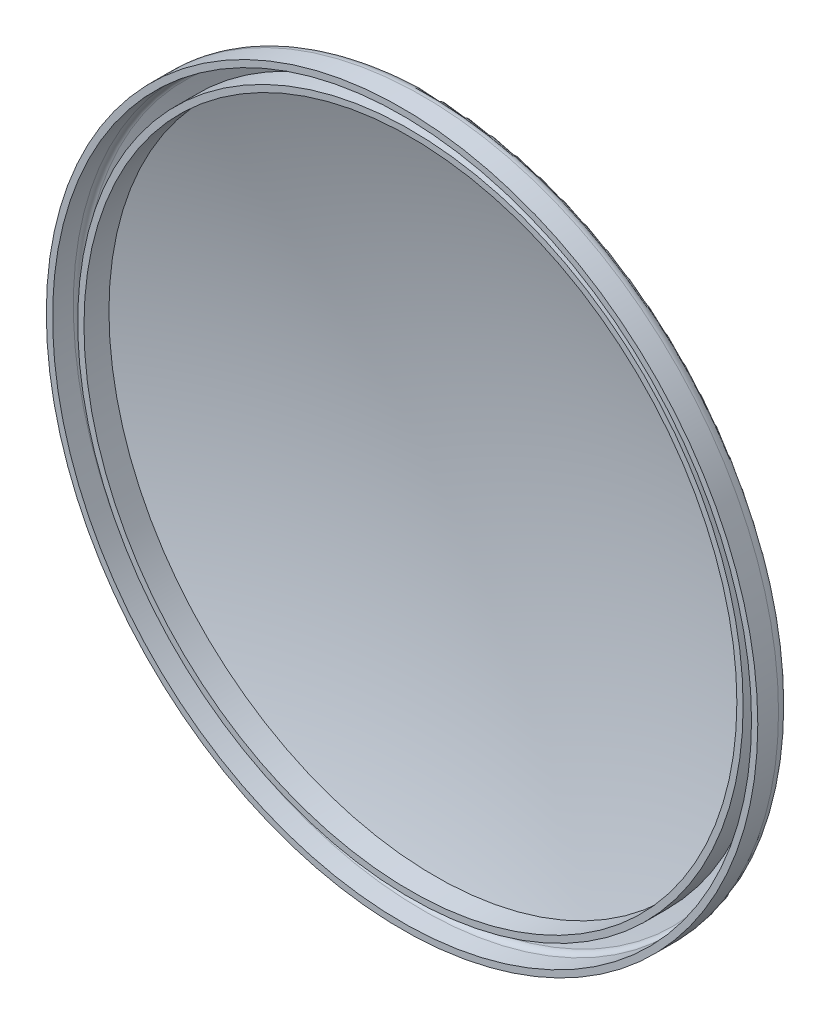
from build123d import *


with BuildPart() as part:
    # Sketch1 → Revolve2 (revolve)
    with BuildSketch(Plane(origin=(0, 0, 0), x_dir=(1, 0, 0), z_dir=(0, 1, 0))):
        with BuildLine():
            Line((0, 71.437500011), (0, 66.675))
            ThreePointArc((0, 66.675), (125.541258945, 56.253515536), (247.65, 25.291112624))
            Line((247.65, 25.291112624), (247.65, 6.35))
            Line((247.65, 6.35), (252.4125, 6.35))
            Line((252.4125, 6.35), (252.4125, 23.636428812))
            ThreePointArc((252.4125, 23.636428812), (257.205856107, 21.935240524), (261.987750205, 20.202095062))
            ThreePointArc((261.987750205, 20.202095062), (264.253920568, 18.457835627), (265.1125, 15.730050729))
            Line((265.1125, 15.730050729), (265.1125, 0))
            Line((265.1125, 0), (269.875, 0))
            Line((269.875, 0), (269.875, 15.730050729))
            ThreePointArc((269.875, 15.730050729), (268.157841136, 21.185620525), (263.62550041, 24.674139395))
            ThreePointArc((263.62550041, 24.674139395), (133.869671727, 59.65158524), (0, 71.437500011))
        make_face()
    revolve(axis=Axis((0, 0, 0), (0, 0, -1)))


solid = part.part
